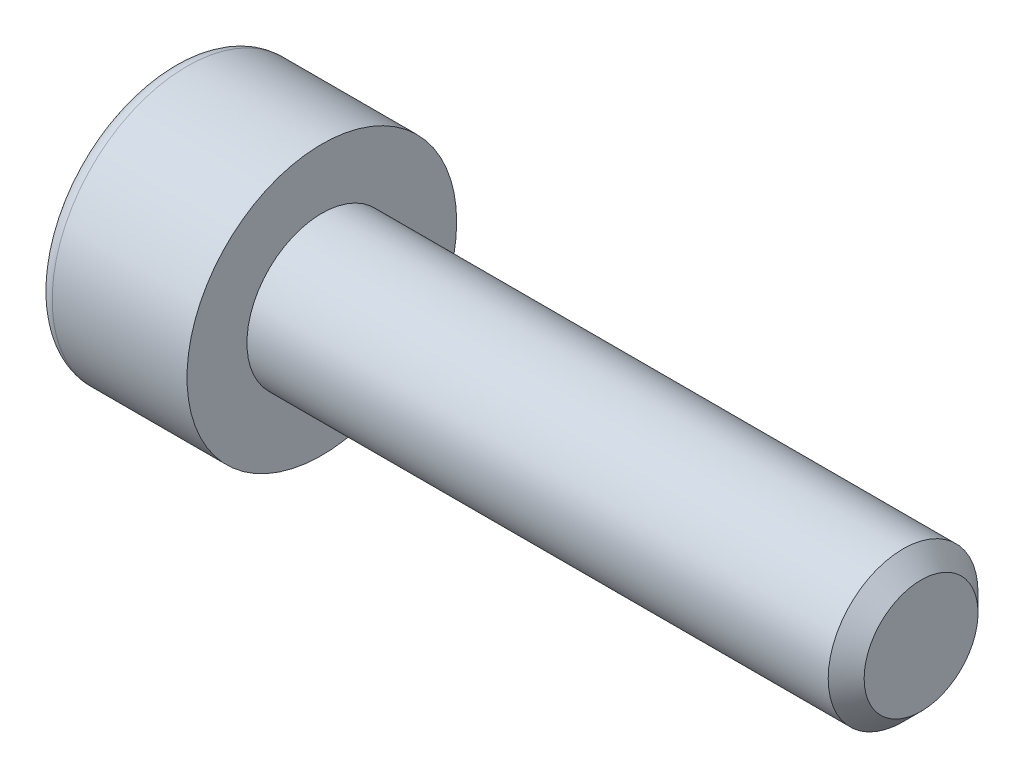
ISO-10303-21;
HEADER;
FILE_DESCRIPTION(('STEP AP214'),'2;1');
FILE_NAME('part.step','',(''),(''),'','','');
FILE_SCHEMA(('AUTOMOTIVE_DESIGN { 1 0 10303 214 1 1 1 1 }'));
ENDSEC;
DATA;
#1=APPLICATION_CONTEXT('core data for automotive mechanical design processes');
#2=APPLICATION_PROTOCOL_DEFINITION('international standard','automotive_design',2000,#1);
#3=PRODUCT_CONTEXT('',#1,'mechanical');
#4=PRODUCT('Part','Part','',(#3));
#5=PRODUCT_RELATED_PRODUCT_CATEGORY('part','',(#4));
#6=PRODUCT_DEFINITION_FORMATION('','',#4);
#7=PRODUCT_DEFINITION_CONTEXT('part definition',#1,'design');
#8=PRODUCT_DEFINITION('design','',#6,#7);
#9=PRODUCT_DEFINITION_SHAPE('','',#8);
#10=(LENGTH_UNIT() NAMED_UNIT(*) SI_UNIT(.MILLI.,.METRE.));
#11=(NAMED_UNIT(*) PLANE_ANGLE_UNIT() SI_UNIT($,.RADIAN.));
#12=(NAMED_UNIT(*) SI_UNIT($,.STERADIAN.) SOLID_ANGLE_UNIT());
#13=UNCERTAINTY_MEASURE_WITH_UNIT(LENGTH_MEASURE(1.E-05),#10,'distance_accuracy_value','');
#14=(GEOMETRIC_REPRESENTATION_CONTEXT(3) GLOBAL_UNCERTAINTY_ASSIGNED_CONTEXT((#13)) GLOBAL_UNIT_ASSIGNED_CONTEXT((#10,
#11,#12)) REPRESENTATION_CONTEXT('',''));
#15=CARTESIAN_POINT('',(0.,0.,0.));
#16=DIRECTION('',(0.,0.,1.));
#17=DIRECTION('',(1.,0.,0.));
#18=AXIS2_PLACEMENT_3D('',#15,#16,#17);
#19=CARTESIAN_POINT('',(-0.850000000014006,0.,0.));
#20=DIRECTION('',(-1.,0.,0.));
#21=DIRECTION('',(0.,0.,1.));
#22=AXIS2_PLACEMENT_3D('',#19,#20,#21);
#23=CONICAL_SURFACE('',#22,0.952380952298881,1.04719755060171);
#24=CARTESIAN_POINT('',(-0.300142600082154,-5.6843418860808E-11,0.));
#25=VERTEX_POINT('',#24);
#26=VERTEX_LOOP('',#25);
#27=FACE_BOUND('',#26,.T.);
#28=CARTESIAN_POINT('',(-0.850000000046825,0.,0.));
#29=DIRECTION('',(-1.,0.,0.));
#30=DIRECTION('',(0.,0.,1.));
#31=AXIS2_PLACEMENT_3D('',#28,#29,#30);
#32=CIRCLE('',#31,0.952380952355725);
#33=CARTESIAN_POINT('',(-0.850000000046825,0.,0.952380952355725));
#34=VERTEX_POINT('',#33);
#35=EDGE_CURVE('E22',#34,#34,#32,.T.);
#36=ORIENTED_EDGE('',*,*,#35,.T.);
#37=EDGE_LOOP('',(#36));
#38=FACE_BOUND('',#37,.T.);
#39=ADVANCED_FACE('F17',(#27,#38),#23,.F.);
#40=CARTESIAN_POINT('',(-0.85,0.,0.));
#41=DIRECTION('',(1.,0.,0.));
#42=DIRECTION('',(0.,0.,-1.));
#43=AXIS2_PLACEMENT_3D('',#40,#41,#42);
#44=PLANE('',#43);
#45=ORIENTED_EDGE('',*,*,#35,.F.);
#46=EDGE_LOOP('',(#45));
#47=FACE_BOUND('',#46,.T.);
#48=DIRECTION('',(0.,0.5,-0.866025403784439));
#49=VECTOR('',#48,1.);
#50=CARTESIAN_POINT('',(-0.85,-1.14892703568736,0.));
#51=LINE('',#50,#49);
#52=CARTESIAN_POINT('',(-0.85,-0.57446350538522,-0.995000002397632));
#53=VERTEX_POINT('',#52);
#54=CARTESIAN_POINT('',(-0.85,-1.14892703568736,0.));
#55=VERTEX_POINT('',#54);
#56=EDGE_CURVE('E282',#53,#55,#51,.F.);
#57=ORIENTED_EDGE('',*,*,#56,.T.);
#58=DIRECTION('',(0.,-0.5,-0.866025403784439));
#59=VECTOR('',#58,1.);
#60=CARTESIAN_POINT('',(-0.85,-0.574463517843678,0.995));
#61=LINE('',#60,#59);
#62=CARTESIAN_POINT('',(-0.85,-0.574463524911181,0.994999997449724));
#63=VERTEX_POINT('',#62);
#64=EDGE_CURVE('E287',#55,#63,#61,.F.);
#65=ORIENTED_EDGE('',*,*,#64,.T.);
#66=DIRECTION('',(0.,1.,0.));
#67=VECTOR('',#66,1.);
#68=CARTESIAN_POINT('',(-0.85,0.574463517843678,0.995));
#69=LINE('',#68,#67);
#70=CARTESIAN_POINT('',(-0.85,0.574463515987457,0.995000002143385));
#71=VERTEX_POINT('',#70);
#72=EDGE_CURVE('E84',#63,#71,#69,.T.);
#73=ORIENTED_EDGE('',*,*,#72,.T.);
#74=DIRECTION('',(0.,-0.5,0.866025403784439));
#75=VECTOR('',#74,1.);
#76=CARTESIAN_POINT('',(-0.85,1.14892703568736,0.));
#77=LINE('',#76,#75);
#78=CARTESIAN_POINT('',(-0.85,1.14892703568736,0.));
#79=VERTEX_POINT('',#78);
#80=EDGE_CURVE('E91',#71,#79,#77,.F.);
#81=ORIENTED_EDGE('',*,*,#80,.T.);
#82=DIRECTION('',(0.,0.5,0.866025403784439));
#83=VECTOR('',#82,1.);
#84=CARTESIAN_POINT('',(-0.85,0.574463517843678,-0.995));
#85=LINE('',#84,#83);
#86=CARTESIAN_POINT('',(-0.85,0.574463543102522,-0.994999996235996));
#87=VERTEX_POINT('',#86);
#88=EDGE_CURVE('E272',#79,#87,#85,.F.);
#89=ORIENTED_EDGE('',*,*,#88,.T.);
#90=DIRECTION('',(0.,1.,0.));
#91=VECTOR('',#90,1.);
#92=CARTESIAN_POINT('',(-0.85,-0.574463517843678,-0.995));
#93=LINE('',#92,#91);
#94=EDGE_CURVE('E275',#87,#53,#93,.F.);
#95=ORIENTED_EDGE('',*,*,#94,.T.);
#96=EDGE_LOOP('',(#57,#65,#73,#81,#89,#95));
#97=FACE_BOUND('',#96,.T.);
#98=ADVANCED_FACE('F148',(#47,#97),#44,.F.);
#99=CARTESIAN_POINT('',(-0.85,0.574463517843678,0.995));
#100=DIRECTION('',(0.,0.,1.));
#101=DIRECTION('',(1.,0.,0.));
#102=AXIS2_PLACEMENT_3D('',#99,#100,#101);
#103=PLANE('',#102);
#104=CARTESIAN_POINT('',(-2.34499999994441,0.,0.995));
#105=CARTESIAN_POINT('',(-2.3449743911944,-0.0305677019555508,0.995));
#106=CARTESIAN_POINT('',(-2.34640800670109,-0.0611198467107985,0.995));
#107=CARTESIAN_POINT('',(-2.35199243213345,-0.121922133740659,0.995));
#108=CARTESIAN_POINT('',(-2.3561383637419,-0.152172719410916,0.995));
#109=CARTESIAN_POINT('',(-2.3668659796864,-0.211759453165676,0.995));
#110=CARTESIAN_POINT('',(-2.37340998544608,-0.241102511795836,0.995));
#111=CARTESIAN_POINT('',(-2.38864217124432,-0.299229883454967,0.995));
#112=CARTESIAN_POINT('',(-2.39733102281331,-0.328014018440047,0.995));
#113=CARTESIAN_POINT('',(-2.41947932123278,-0.393688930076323,0.995));
#114=CARTESIAN_POINT('',(-2.43358464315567,-0.430359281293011,0.995));
#115=CARTESIAN_POINT('',(-2.46443795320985,-0.50302343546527,0.995));
#116=CARTESIAN_POINT('',(-2.48121157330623,-0.53900643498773,0.995));
#117=CARTESIAN_POINT('',(-2.49892704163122,-0.574463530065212,0.995));
#118=B_SPLINE_CURVE_WITH_KNOTS('',3,(#104,#105,#106,#107,#108,#109,#110,#111,#112,#113,#114,
#115,#116,#117),.UNSPECIFIED.,.F.,.F.,(4,2,2,2,2,2,4),(0.,0.0916446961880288,0.183125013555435,
0.273225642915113,0.36335451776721,0.481117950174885,0.600089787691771),.UNSPECIFIED.);
#119=CARTESIAN_POINT('',(-2.34499999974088,0.,0.994999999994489));
#120=VERTEX_POINT('',#119);
#121=CARTESIAN_POINT('',(-2.49892703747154,-0.574463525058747,0.994999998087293));
#122=VERTEX_POINT('',#121);
#123=EDGE_CURVE('E79',#120,#122,#118,.T.);
#124=ORIENTED_EDGE('',*,*,#123,.F.);
#125=CARTESIAN_POINT('',(-2.49892703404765,0.574463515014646,0.995));
#126=CARTESIAN_POINT('',(-2.47907510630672,0.534722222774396,0.995));
#127=CARTESIAN_POINT('',(-2.46039599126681,0.49430925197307,0.995));
#128=CARTESIAN_POINT('',(-2.42621425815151,0.411872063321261,0.995));
#129=CARTESIAN_POINT('',(-2.41073261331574,0.36983922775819,0.995));
#130=CARTESIAN_POINT('',(-2.38444123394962,0.285641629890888,0.995));
#131=CARTESIAN_POINT('',(-2.37350879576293,0.243516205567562,0.995));
#132=CARTESIAN_POINT('',(-2.35666503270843,0.15836168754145,0.995));
#133=CARTESIAN_POINT('',(-2.35073836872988,0.115335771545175,0.995));
#134=CARTESIAN_POINT('',(-2.34674431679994,0.0601561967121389,0.995));
#135=CARTESIAN_POINT('',(-2.34609249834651,0.048163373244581,0.995));
#136=CARTESIAN_POINT('',(-2.34521965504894,0.0241145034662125,0.995));
#137=CARTESIAN_POINT('',(-2.34500034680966,0.0120583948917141,0.995));
#138=CARTESIAN_POINT('',(-2.34499999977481,6.10102043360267E-13,0.995));
#139=B_SPLINE_CURVE_WITH_KNOTS('',3,(#125,#126,#127,#128,#129,#130,#131,#132,#133,#134,#135,
#136,#137,#138),.UNSPECIFIED.,.F.,.F.,(4,2,2,2,2,2,4),(0.,0.133369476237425,0.267587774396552,
0.397905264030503,0.527821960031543,0.563847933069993,0.600016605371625),.UNSPECIFIED.);
#140=CARTESIAN_POINT('',(-2.49892703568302,0.574463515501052,0.995000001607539));
#141=VERTEX_POINT('',#140);
#142=EDGE_CURVE('E72',#141,#120,#139,.T.);
#143=ORIENTED_EDGE('',*,*,#142,.F.);
#144=DIRECTION('',(1.,0.,0.));
#145=VECTOR('',#144,1.);
#146=CARTESIAN_POINT('',(-0.85,0.574463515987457,0.995000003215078));
#147=LINE('',#146,#145);
#148=EDGE_CURVE('E76',#141,#71,#147,.T.);
#149=ORIENTED_EDGE('',*,*,#148,.T.);
#150=ORIENTED_EDGE('',*,*,#72,.F.);
#151=DIRECTION('',(1.,0.,0.));
#152=VECTOR('',#151,1.);
#153=CARTESIAN_POINT('',(-0.85,-0.574463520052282,0.994999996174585));
#154=LINE('',#153,#152);
#155=EDGE_CURVE('E284',#63,#122,#154,.F.);
#156=ORIENTED_EDGE('',*,*,#155,.T.);
#157=EDGE_LOOP('',(#124,#143,#149,#150,#156));
#158=FACE_BOUND('',#157,.T.);
#159=ADVANCED_FACE('F74',(#158),#103,.F.);
#160=CARTESIAN_POINT('',(-0.85,-0.574463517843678,0.995));
#161=DIRECTION('',(0.,-0.866025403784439,0.5));
#162=DIRECTION('',(0.,-0.5,-0.866025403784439));
#163=AXIS2_PLACEMENT_3D('',#160,#161,#162);
#164=PLANE('',#163);
#165=CARTESIAN_POINT('',(-2.49913739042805,-1.14913733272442,-0.00036424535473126));
#166=CARTESIAN_POINT('',(-2.47938857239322,-1.12938020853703,0.0338560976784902));
#167=CARTESIAN_POINT('',(-2.46079873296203,-1.10929266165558,0.0686487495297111));
#168=CARTESIAN_POINT('',(-2.42675971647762,-1.0683313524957,0.13959581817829));
#169=CARTESIAN_POINT('',(-2.4113295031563,-1.04745368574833,0.175756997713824));
#170=CARTESIAN_POINT('',(-2.38489633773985,-1.00535430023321,0.248675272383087));
#171=CARTESIAN_POINT('',(-2.37382694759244,-0.98414331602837,0.285413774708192));
#172=CARTESIAN_POINT('',(-2.35677080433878,-0.94125421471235,0.35969987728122));
#173=CARTESIAN_POINT('',(-2.35077130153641,-0.91957741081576,0.397245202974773));
#174=CARTESIAN_POINT('',(-2.34536065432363,-0.8822249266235,0.461941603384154));
#175=CARTESIAN_POINT('',(-2.34455998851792,-0.866597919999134,0.489008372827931));
#176=CARTESIAN_POINT('',(-2.34590101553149,-0.835374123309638,0.543089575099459));
#177=CARTESIAN_POINT('',(-2.34804335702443,-0.819777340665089,0.570103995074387));
#178=CARTESIAN_POINT('',(-2.35874331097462,-0.773209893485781,0.650761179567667));
#179=CARTESIAN_POINT('',(-2.37157503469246,-0.742470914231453,0.704002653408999));
#180=CARTESIAN_POINT('',(-2.40253293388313,-0.688539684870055,0.797414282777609));
#181=CARTESIAN_POINT('',(-2.41903118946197,-0.66509374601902,0.838023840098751));
#182=CARTESIAN_POINT('',(-2.45619453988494,-0.619119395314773,0.91765375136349));
#183=CARTESIAN_POINT('',(-2.47684610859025,-0.596588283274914,0.956678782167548));
#184=CARTESIAN_POINT('',(-2.49892703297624,-0.574463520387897,0.994999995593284));
#185=B_SPLINE_CURVE_WITH_KNOTS('',3,(#165,#166,#167,#168,#169,#170,#171,#172,#173,#174,#175,
#176,#177,#178,#179,#180,#181,#182,#183,#184),.UNSPECIFIED.,.F.,.F.,(4,2,2,2,2,2,2,2,2,4),(0.,
0.132615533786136,0.266005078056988,0.397275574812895,0.528214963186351,0.621871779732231,
0.715549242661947,0.902956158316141,1.0518860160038,1.20033848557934),.UNSPECIFIED.);
#186=CARTESIAN_POINT('',(-2.49967441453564,-1.14925495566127,1.37088865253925E-05));
#187=VERTEX_POINT('',#186);
#188=EDGE_CURVE('E92',#187,#122,#185,.T.);
#189=ORIENTED_EDGE('',*,*,#188,.T.);
#190=ORIENTED_EDGE('',*,*,#155,.F.);
#191=ORIENTED_EDGE('',*,*,#64,.F.);
#192=DIRECTION('',(-1.,0.,0.));
#193=VECTOR('',#192,1.);
#194=CARTESIAN_POINT('',(-0.85,-1.14892703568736,0.));
#195=LINE('',#194,#193);
#196=EDGE_CURVE('E245',#55,#187,#195,.T.);
#197=ORIENTED_EDGE('',*,*,#196,.T.);
#198=EDGE_LOOP('',(#189,#190,#191,#197));
#199=FACE_BOUND('',#198,.T.);
#200=ADVANCED_FACE('F147',(#199),#164,.F.);
#201=CARTESIAN_POINT('',(-0.85,-1.14892703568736,0.));
#202=DIRECTION('',(0.,-0.866025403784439,-0.5));
#203=DIRECTION('',(0.,0.5,-0.866025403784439));
#204=AXIS2_PLACEMENT_3D('',#201,#202,#203);
#205=PLANE('',#204);
#206=CARTESIAN_POINT('',(-2.49892702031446,-0.574463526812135,-0.994999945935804));
#207=CARTESIAN_POINT('',(-2.47920125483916,-0.594208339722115,-0.960800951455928));
#208=CARTESIAN_POINT('',(-2.46063412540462,-0.614283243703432,-0.926030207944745));
#209=CARTESIAN_POINT('',(-2.42663854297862,-0.655218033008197,-0.855129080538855));
#210=CARTESIAN_POINT('',(-2.41122899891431,-0.676081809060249,-0.818991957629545));
#211=CARTESIAN_POINT('',(-2.38483285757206,-0.718152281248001,-0.746123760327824));
#212=CARTESIAN_POINT('',(-2.37377984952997,-0.739348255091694,-0.709411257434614));
#213=CARTESIAN_POINT('',(-2.35674986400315,-0.782206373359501,-0.635178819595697));
#214=CARTESIAN_POINT('',(-2.35076018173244,-0.803867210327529,-0.597661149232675));
#215=CARTESIAN_POINT('',(-2.34535763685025,-0.841202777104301,-0.532994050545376));
#216=CARTESIAN_POINT('',(-2.34455932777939,-0.856829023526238,-0.505928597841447));
#217=CARTESIAN_POINT('',(-2.34590474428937,-0.888051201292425,-0.451850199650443));
#218=CARTESIAN_POINT('',(-2.34804911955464,-0.903647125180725,-0.424837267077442));
#219=CARTESIAN_POINT('',(-2.35875462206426,-0.950212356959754,-0.344183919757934));
#220=CARTESIAN_POINT('',(-2.37158937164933,-0.980949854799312,-0.290945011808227));
#221=CARTESIAN_POINT('',(-2.40257169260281,-1.03491414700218,-0.197476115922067));
#222=CARTESIAN_POINT('',(-2.41909998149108,-1.0583933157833,-0.156809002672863));
#223=CARTESIAN_POINT('',(-2.45633304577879,-1.10443127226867,-0.0770689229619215));
#224=CARTESIAN_POINT('',(-2.47702419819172,-1.12699278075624,-0.0379912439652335));
#225=CARTESIAN_POINT('',(-2.49914689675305,-1.14914683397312,0.000380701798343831));
#226=B_SPLINE_CURVE_WITH_KNOTS('',3,(#206,#207,#208,#209,#210,#211,#212,#213,#214,#215,#216,
#217,#218,#219,#220,#221,#222,#223,#224,#225),.UNSPECIFIED.,.F.,.F.,(4,2,2,2,2,2,2,2,2,4),(0.,
0.132518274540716,0.265808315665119,0.396979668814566,0.527820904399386,0.621472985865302,
0.715145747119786,0.902546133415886,1.05169311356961,1.20035972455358),.UNSPECIFIED.);
#227=CARTESIAN_POINT('',(-2.49892702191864,-0.57446349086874,-0.995));
#228=VERTEX_POINT('',#227);
#229=EDGE_CURVE('E238',#228,#187,#226,.T.);
#230=ORIENTED_EDGE('',*,*,#229,.T.);
#231=ORIENTED_EDGE('',*,*,#196,.F.);
#232=ORIENTED_EDGE('',*,*,#56,.F.);
#233=DIRECTION('',(-1.,0.,0.));
#234=VECTOR('',#233,1.);
#235=CARTESIAN_POINT('',(-0.85,-0.5744635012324,-0.995));
#236=LINE('',#235,#234);
#237=EDGE_CURVE('E279',#53,#228,#236,.T.);
#238=ORIENTED_EDGE('',*,*,#237,.T.);
#239=EDGE_LOOP('',(#230,#231,#232,#238));
#240=FACE_BOUND('',#239,.T.);
#241=ADVANCED_FACE('F154',(#240),#205,.F.);
#242=CARTESIAN_POINT('',(-0.85,0.574463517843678,-0.995));
#243=DIRECTION('',(0.,0.866025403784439,-0.5));
#244=DIRECTION('',(0.,0.5,0.866025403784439));
#245=AXIS2_PLACEMENT_3D('',#242,#243,#244);
#246=PLANE('',#245);
#247=CARTESIAN_POINT('',(-2.49913349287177,1.14913343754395,0.000357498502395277));
#248=CARTESIAN_POINT('',(-2.47938510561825,1.12937654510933,-0.0338624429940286));
#249=CARTESIAN_POINT('',(-2.46079569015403,1.10928923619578,-0.0686546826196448));
#250=CARTESIAN_POINT('',(-2.42675748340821,1.06832842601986,-0.139600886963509));
#251=CARTESIAN_POINT('',(-2.41132765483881,1.04745102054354,-0.17576161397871));
#252=CARTESIAN_POINT('',(-2.38489517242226,1.00535217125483,-0.24867895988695));
#253=CARTESIAN_POINT('',(-2.37382608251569,0.984141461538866,-0.285416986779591));
#254=CARTESIAN_POINT('',(-2.35677041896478,0.941252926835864,-0.359702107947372));
#255=CARTESIAN_POINT('',(-2.35077109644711,0.919576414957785,-0.397246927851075));
#256=CARTESIAN_POINT('',(-2.34536059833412,0.882224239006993,-0.461942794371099));
#257=CARTESIAN_POINT('',(-2.34455997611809,0.866597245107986,-0.489009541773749));
#258=CARTESIAN_POINT('',(-2.34590108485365,0.835373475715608,-0.543090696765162));
#259=CARTESIAN_POINT('',(-2.34804346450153,0.819776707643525,-0.570105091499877));
#260=CARTESIAN_POINT('',(-2.35874352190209,0.7732093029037,-0.650762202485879));
#261=CARTESIAN_POINT('',(-2.37157530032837,0.742470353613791,-0.704003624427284));
#262=CARTESIAN_POINT('',(-2.40253322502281,0.688539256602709,-0.797415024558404));
#263=CARTESIAN_POINT('',(-2.41903143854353,0.665093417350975,-0.8380244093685));
#264=CARTESIAN_POINT('',(-2.45619466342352,0.619119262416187,-0.917653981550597));
#265=CARTESIAN_POINT('',(-2.47684614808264,0.596588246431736,-0.956678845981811));
#266=CARTESIAN_POINT('',(-2.49892697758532,0.574463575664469,-0.994999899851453));
#267=B_SPLINE_CURVE_WITH_KNOTS('',3,(#247,#248,#249,#250,#251,#252,#253,#254,#255,#256,#257,
#258,#259,#260,#261,#262,#263,#264,#265,#266),.UNSPECIFIED.,.F.,.F.,(4,2,2,2,2,2,2,2,2,4),(0.,
0.132613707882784,0.26600138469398,0.397270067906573,0.528207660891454,0.621864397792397,
0.715541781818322,0.902948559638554,1.05187781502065,1.20032966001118),.UNSPECIFIED.);
#268=CARTESIAN_POINT('',(-2.49967445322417,1.14925510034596,-2.50553599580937E-05));
#269=VERTEX_POINT('',#268);
#270=CARTESIAN_POINT('',(-2.49892701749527,0.574463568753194,-0.994999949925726));
#271=VERTEX_POINT('',#270);
#272=EDGE_CURVE('E239',#269,#271,#267,.T.);
#273=ORIENTED_EDGE('',*,*,#272,.T.);
#274=DIRECTION('',(-1.,0.,0.));
#275=VECTOR('',#274,1.);
#276=CARTESIAN_POINT('',(-0.85,0.574463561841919,-0.995));
#277=LINE('',#276,#275);
#278=EDGE_CURVE('E269',#271,#87,#277,.F.);
#279=ORIENTED_EDGE('',*,*,#278,.T.);
#280=ORIENTED_EDGE('',*,*,#88,.F.);
#281=DIRECTION('',(-1.,0.,0.));
#282=VECTOR('',#281,1.);
#283=CARTESIAN_POINT('',(-0.85,1.14892703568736,0.));
#284=LINE('',#283,#282);
#285=EDGE_CURVE('E93',#79,#269,#284,.T.);
#286=ORIENTED_EDGE('',*,*,#285,.T.);
#287=EDGE_LOOP('',(#273,#279,#280,#286));
#288=FACE_BOUND('',#287,.T.);
#289=ADVANCED_FACE('F303',(#288),#246,.F.);
#290=CARTESIAN_POINT('',(-0.85,-0.574463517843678,-0.995));
#291=DIRECTION('',(0.,0.,-1.));
#292=DIRECTION('',(-1.,0.,0.));
#293=AXIS2_PLACEMENT_3D('',#290,#291,#292);
#294=PLANE('',#293);
#295=CARTESIAN_POINT('',(-2.49892707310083,0.57446354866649,-0.994999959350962));
#296=CARTESIAN_POINT('',(-2.47920148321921,0.534974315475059,-0.994999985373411));
#297=CARTESIAN_POINT('',(-2.4606345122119,0.494824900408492,-0.994999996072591));
#298=CARTESIAN_POINT('',(-2.42663917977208,0.412956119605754,-0.995000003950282));
#299=CARTESIAN_POINT('',(-2.41122972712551,0.371228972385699,-0.995000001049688));
#300=CARTESIAN_POINT('',(-2.38483342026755,0.287088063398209,-0.994999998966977));
#301=CARTESIAN_POINT('',(-2.37378023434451,0.244695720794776,-0.994999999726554));
#302=CARTESIAN_POINT('',(-2.35674998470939,0.158978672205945,-0.995000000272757));
#303=CARTESIAN_POINT('',(-2.35076021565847,0.11565658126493,-0.995000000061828));
#304=CARTESIAN_POINT('',(-2.34535762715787,0.0409848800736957,-0.994999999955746));
#305=CARTESIAN_POINT('',(-2.34455932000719,0.00973223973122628,-0.99499999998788));
#306=CARTESIAN_POINT('',(-2.34590476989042,-0.0527124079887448,-0.995000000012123));
#307=CARTESIAN_POINT('',(-2.34804917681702,-0.0839044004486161,-0.995000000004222));
#308=CARTESIAN_POINT('',(-2.35875473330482,-0.17703472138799,-0.994999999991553));
#309=CARTESIAN_POINT('',(-2.37158942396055,-0.238509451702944,-0.994999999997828));
#310=CARTESIAN_POINT('',(-2.40254901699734,-0.346358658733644,-0.995000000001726));
#311=CARTESIAN_POINT('',(-2.41904542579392,-0.393240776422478,-0.995000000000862));
#312=CARTESIAN_POINT('',(-2.45620299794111,-0.48517024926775,-0.994999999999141));
#313=CARTESIAN_POINT('',(-2.47685060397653,-0.530223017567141,-0.994999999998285));
#314=CARTESIAN_POINT('',(-2.49892701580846,-0.574463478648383,-0.995));
#315=B_SPLINE_CURVE_WITH_KNOTS('',3,(#295,#296,#297,#298,#299,#300,#301,#302,#303,#304,#305,
#306,#307,#308,#309,#310,#311,#312,#313,#314),.UNSPECIFIED.,.F.,.F.,(4,2,2,2,2,2,2,2,2,4),(0.,
0.13251703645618,0.26580584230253,0.396978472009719,0.527820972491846,0.621473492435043,
0.71514669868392,0.902546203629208,1.05144676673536,1.19986871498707),.UNSPECIFIED.);
#316=EDGE_CURVE('E106',#271,#228,#315,.T.);
#317=ORIENTED_EDGE('',*,*,#316,.T.);
#318=ORIENTED_EDGE('',*,*,#237,.F.);
#319=ORIENTED_EDGE('',*,*,#94,.F.);
#320=ORIENTED_EDGE('',*,*,#278,.F.);
#321=EDGE_LOOP('',(#317,#318,#319,#320));
#322=FACE_BOUND('',#321,.T.);
#323=ADVANCED_FACE('F179',(#322),#294,.F.);
#324=CARTESIAN_POINT('',(-0.85,1.14892703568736,0.));
#325=DIRECTION('',(0.,0.866025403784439,0.5));
#326=DIRECTION('',(0.,-0.5,0.866025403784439));
#327=AXIS2_PLACEMENT_3D('',#324,#325,#326);
#328=PLANE('',#327);
#329=CARTESIAN_POINT('',(-2.49892703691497,0.574463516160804,0.995000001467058));
#330=CARTESIAN_POINT('',(-2.47920127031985,0.594208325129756,0.960800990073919));
#331=CARTESIAN_POINT('',(-2.46063413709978,0.61428323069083,0.926030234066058));
#332=CARTESIAN_POINT('',(-2.42663854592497,0.655218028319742,0.855129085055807));
#333=CARTESIAN_POINT('',(-2.41122899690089,0.676081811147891,0.818991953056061));
#334=CARTESIAN_POINT('',(-2.38483285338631,0.71815228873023,0.746123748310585));
#335=CARTESIAN_POINT('',(-2.37377984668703,0.739348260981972,0.709411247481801));
#336=CARTESIAN_POINT('',(-2.35674986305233,0.782206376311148,0.635178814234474));
#337=CARTESIAN_POINT('',(-2.35076018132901,0.803867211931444,0.597661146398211));
#338=CARTESIAN_POINT('',(-2.34535763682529,0.841202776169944,0.5329940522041));
#339=CARTESIAN_POINT('',(-2.34455932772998,0.856829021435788,0.50592860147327));
#340=CARTESIAN_POINT('',(-2.34590474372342,0.888051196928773,0.451850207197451));
#341=CARTESIAN_POINT('',(-2.3480491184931,0.903647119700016,0.424837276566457));
#342=CARTESIAN_POINT('',(-2.35875462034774,0.950212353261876,0.344183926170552));
#343=CARTESIAN_POINT('',(-2.37158937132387,0.98094985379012,0.290945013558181));
#344=CARTESIAN_POINT('',(-2.40257210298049,1.03491486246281,0.197474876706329));
#345=CARTESIAN_POINT('',(-2.41910096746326,1.05839471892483,0.156806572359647));
#346=CARTESIAN_POINT('',(-2.45633539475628,1.10443399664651,0.0770642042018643));
#347=CARTESIAN_POINT('',(-2.47702733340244,1.12699613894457,0.0379854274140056));
#348=CARTESIAN_POINT('',(-2.49915086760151,1.14915080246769,-0.000387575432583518));
#349=B_SPLINE_CURVE_WITH_KNOTS('',3,(#329,#330,#331,#332,#333,#334,#335,#336,#337,#338,#339,
#340,#341,#342,#343,#344,#345,#346,#347,#348),.UNSPECIFIED.,.F.,.F.,(4,2,2,2,2,2,2,2,2,4),(0.,
0.132518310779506,0.26580838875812,0.396979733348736,0.52782096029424,0.621473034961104,
0.715145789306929,0.90254619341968,1.05169762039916,1.20036864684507),.UNSPECIFIED.);
#350=EDGE_CURVE('E89',#141,#269,#349,.T.);
#351=ORIENTED_EDGE('',*,*,#350,.T.);
#352=ORIENTED_EDGE('',*,*,#285,.F.);
#353=ORIENTED_EDGE('',*,*,#80,.F.);
#354=ORIENTED_EDGE('',*,*,#148,.F.);
#355=EDGE_LOOP('',(#351,#352,#353,#354));
#356=FACE_BOUND('',#355,.T.);
#357=ADVANCED_FACE('F87',(#356),#328,.F.);
#358=CARTESIAN_POINT('',(-2.50093213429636,0.,0.));
#359=DIRECTION('',(-1.,0.,0.));
#360=DIRECTION('',(0.,0.,1.));
#361=AXIS2_PLACEMENT_3D('',#358,#359,#360);
#362=CONICAL_SURFACE('',#361,1.15093213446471,0.785398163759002);
#363=CARTESIAN_POINT('',(-2.5,0.,0.));
#364=DIRECTION('',(-1.,0.,0.));
#365=DIRECTION('',(0.,0.,1.));
#366=AXIS2_PLACEMENT_3D('',#363,#364,#365);
#367=CIRCLE('',#366,1.15000000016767);
#368=CARTESIAN_POINT('',(-2.49999999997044,0.,1.15000000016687));
#369=VERTEX_POINT('',#368);
#370=EDGE_CURVE('E100',#369,#187,#367,.F.);
#371=ORIENTED_EDGE('',*,*,#370,.F.);
#372=DIRECTION('',(0.707106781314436,0.,-0.707106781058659));
#373=VECTOR('',#372,1.);
#374=CARTESIAN_POINT('',(-499000.,0.,498998.649819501));
#375=LINE('',#374,#373);
#376=EDGE_CURVE('E101',#369,#120,#375,.T.);
#377=ORIENTED_EDGE('',*,*,#376,.T.);
#378=ORIENTED_EDGE('',*,*,#123,.T.);
#379=ORIENTED_EDGE('',*,*,#188,.F.);
#380=EDGE_LOOP('',(#371,#377,#378,#379));
#381=FACE_BOUND('',#380,.T.);
#382=ADVANCED_FACE('F167',(#381),#362,.F.);
#383=CARTESIAN_POINT('',(-2.49946299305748,0.,0.));
#384=DIRECTION('',(-1.,0.,0.));
#385=DIRECTION('',(0.,0.,1.));
#386=AXIS2_PLACEMENT_3D('',#383,#384,#385);
#387=CONICAL_SURFACE('',#386,1.14946299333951,0.785398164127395);
#388=ORIENTED_EDGE('',*,*,#272,.F.);
#389=CARTESIAN_POINT('',(-2.5,0.,0.));
#390=DIRECTION('',(-1.,0.,0.));
#391=DIRECTION('',(0.,0.,1.));
#392=AXIS2_PLACEMENT_3D('',#389,#390,#391);
#393=CIRCLE('',#392,1.15000000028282);
#394=EDGE_CURVE('E104',#187,#269,#393,.F.);
#395=ORIENTED_EDGE('',*,*,#394,.F.);
#396=ORIENTED_EDGE('',*,*,#229,.F.);
#397=ORIENTED_EDGE('',*,*,#316,.F.);
#398=EDGE_LOOP('',(#388,#395,#396,#397));
#399=FACE_BOUND('',#398,.T.);
#400=ADVANCED_FACE('F130',(#399),#387,.F.);
#401=CARTESIAN_POINT('',(-2.5009317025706,0.,0.));
#402=DIRECTION('',(-1.,0.,0.));
#403=DIRECTION('',(0.,0.,1.));
#404=AXIS2_PLACEMENT_3D('',#401,#402,#403);
#405=CONICAL_SURFACE('',#404,1.15093170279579,0.785398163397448);
#406=ORIENTED_EDGE('',*,*,#350,.F.);
#407=ORIENTED_EDGE('',*,*,#142,.T.);
#408=ORIENTED_EDGE('',*,*,#376,.F.);
#409=CARTESIAN_POINT('',(-2.5,0.,0.));
#410=DIRECTION('',(-1.,0.,0.));
#411=DIRECTION('',(0.,0.,1.));
#412=AXIS2_PLACEMENT_3D('',#409,#410,#411);
#413=CIRCLE('',#412,1.15000000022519);
#414=EDGE_CURVE('E98',#269,#369,#413,.F.);
#415=ORIENTED_EDGE('',*,*,#414,.F.);
#416=EDGE_LOOP('',(#406,#407,#408,#415));
#417=FACE_BOUND('',#416,.T.);
#418=ADVANCED_FACE('F96',(#417),#405,.F.);
#419=CARTESIAN_POINT('',(-2.5,1.575,0.));
#420=DIRECTION('',(-1.,0.,0.));
#421=DIRECTION('',(0.,0.,1.));
#422=AXIS2_PLACEMENT_3D('',#419,#420,#421);
#423=PLANE('',#422);
#424=ORIENTED_EDGE('',*,*,#394,.T.);
#425=ORIENTED_EDGE('',*,*,#414,.T.);
#426=ORIENTED_EDGE('',*,*,#370,.T.);
#427=EDGE_LOOP('',(#424,#425,#426));
#428=FACE_BOUND('',#427,.T.);
#429=CARTESIAN_POINT('',(-2.5,0.,1.99999999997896));
#430=CARTESIAN_POINT('',(-2.50000000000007,-0.0213602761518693,1.99999441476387));
#431=CARTESIAN_POINT('',(-2.49999999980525,-0.0427203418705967,1.99964659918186));
#432=CARTESIAN_POINT('',(-2.49999999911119,-0.0850058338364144,1.99828072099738));
#433=CARTESIAN_POINT('',(-2.4999999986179,-0.105931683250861,1.99727573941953));
#434=CARTESIAN_POINT('',(-2.49999999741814,-0.14732977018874,1.99463547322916));
#435=CARTESIAN_POINT('',(-2.49999999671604,-0.16780282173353,1.99301299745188));
#436=CARTESIAN_POINT('',(-2.49999999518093,-0.208277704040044,1.98917779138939));
#437=CARTESIAN_POINT('',(-2.49999999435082,-0.228280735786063,1.98697757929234));
#438=CARTESIAN_POINT('',(-2.49999999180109,-0.2869478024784,1.97962724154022));
#439=CARTESIAN_POINT('',(-2.49999998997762,-0.325511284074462,1.97364625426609));
#440=CARTESIAN_POINT('',(-2.49999998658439,-0.400597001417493,1.95974219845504));
#441=CARTESIAN_POINT('',(-2.49999998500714,-0.437136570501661,1.95191200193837));
#442=CARTESIAN_POINT('',(-2.49999998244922,-0.508117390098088,1.93461016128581));
#443=CARTESIAN_POINT('',(-2.49999998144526,-0.542580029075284,1.92522630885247));
#444=CARTESIAN_POINT('',(-2.49999998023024,-0.609373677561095,1.90510517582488));
#445=CARTESIAN_POINT('',(-2.49999997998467,-0.641729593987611,1.89445048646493));
#446=CARTESIAN_POINT('',(-2.49999998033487,-0.70430210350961,1.87206087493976));
#447=CARTESIAN_POINT('',(-2.49999998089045,-0.734546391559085,1.86040330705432));
#448=CARTESIAN_POINT('',(-2.49999998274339,-0.792908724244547,1.83626519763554));
#449=CARTESIAN_POINT('',(-2.49999998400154,-0.821056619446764,1.82385678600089));
#450=CARTESIAN_POINT('',(-2.49999998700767,-0.875257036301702,1.79845747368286));
#451=CARTESIAN_POINT('',(-2.49999998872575,-0.901340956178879,1.78553353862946));
#452=CARTESIAN_POINT('',(-2.49999999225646,-0.951458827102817,1.75932646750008));
#453=CARTESIAN_POINT('',(-2.49999999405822,-0.97552516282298,1.74610523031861));
#454=CARTESIAN_POINT('',(-2.49999999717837,-1.02166493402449,1.71950950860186));
#455=CARTESIAN_POINT('',(-2.4999999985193,-1.04377121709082,1.70619198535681));
#456=CARTESIAN_POINT('',(-2.50000000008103,-1.08605666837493,1.67959251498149));
#457=CARTESIAN_POINT('',(-2.50000000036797,-1.10626867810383,1.66636274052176));
#458=CARTESIAN_POINT('',(-2.49999999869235,-1.14483826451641,1.64011061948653));
#459=CARTESIAN_POINT('',(-2.49999999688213,-1.16322820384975,1.62713583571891));
#460=CARTESIAN_POINT('',(-2.49999999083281,-1.19822860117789,1.60154977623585));
#461=CARTESIAN_POINT('',(-2.49999998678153,-1.2148706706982,1.58898159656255));
#462=CARTESIAN_POINT('',(-2.49999996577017,-1.26029768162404,1.55355457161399));
#463=CARTESIAN_POINT('',(-2.49999994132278,-1.28866620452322,1.53015601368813));
#464=CARTESIAN_POINT('',(-2.49999989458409,-1.32996111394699,1.49414084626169));
#465=CARTESIAN_POINT('',(-2.49999987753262,-1.34339577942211,1.48210030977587));
#466=CARTESIAN_POINT('',(-2.49999980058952,-1.36836778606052,1.45913822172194));
#467=CARTESIAN_POINT('',(-2.49999974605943,-1.37994004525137,1.44825484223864));
#468=CARTESIAN_POINT('',(-2.49999972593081,-1.3944580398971,1.43421990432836));
#469=CARTESIAN_POINT('',(-2.49999972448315,-1.39754467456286,1.43121361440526));
#470=CARTESIAN_POINT('',(-2.49999972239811,-1.40784842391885,1.42111055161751));
#471=CARTESIAN_POINT('',(-2.49999972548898,-1.41501988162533,1.41396715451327));
#472=CARTESIAN_POINT('',(-2.49999973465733,-1.43560517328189,1.39314830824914));
#473=CARTESIAN_POINT('',(-2.49999974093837,-1.44887796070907,1.37933302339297));
#474=CARTESIAN_POINT('',(-2.49999975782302,-1.4804187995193,1.34554263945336));
#475=CARTESIAN_POINT('',(-2.49999976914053,-1.49848605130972,1.32537992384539));
#476=CARTESIAN_POINT('',(-2.49999979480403,-1.53894678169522,1.2783380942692));
#477=CARTESIAN_POINT('',(-2.49999980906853,-1.5610615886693,1.25121811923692));
#478=CARTESIAN_POINT('',(-2.49999983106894,-1.594955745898,1.20735154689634));
#479=CARTESIAN_POINT('',(-2.49999983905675,-1.60721444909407,1.19097245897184));
#480=CARTESIAN_POINT('',(-2.49999985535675,-1.63238460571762,1.15624388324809));
#481=CARTESIAN_POINT('',(-2.49999986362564,-1.64524459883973,1.13785698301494));
#482=CARTESIAN_POINT('',(-2.49999987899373,-1.66942628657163,1.10201320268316));
#483=CARTESIAN_POINT('',(-2.49999988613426,-1.6807918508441,1.08458586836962));
#484=CARTESIAN_POINT('',(-2.49999990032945,-1.70374837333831,1.04815569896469));
#485=CARTESIAN_POINT('',(-2.4999999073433,-1.71529964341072,1.02912783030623));
#486=CARTESIAN_POINT('',(-2.49999992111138,-1.73849367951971,0.989442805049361));
#487=CARTESIAN_POINT('',(-2.4999999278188,-1.75009320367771,0.968760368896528));
#488=CARTESIAN_POINT('',(-2.49999994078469,-1.77323752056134,0.925716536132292));
#489=CARTESIAN_POINT('',(-2.49999994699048,-1.78473541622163,0.903329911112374));
#490=CARTESIAN_POINT('',(-2.49999995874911,-1.80751745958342,0.856834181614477));
#491=CARTESIAN_POINT('',(-2.49999996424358,-1.81875095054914,0.83270024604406));
#492=CARTESIAN_POINT('',(-2.49999997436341,-1.84083232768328,0.782674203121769));
#493=CARTESIAN_POINT('',(-2.49999997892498,-1.85162571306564,0.756758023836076));
#494=CARTESIAN_POINT('',(-2.49999998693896,-1.87264222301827,0.703142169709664));
#495=CARTESIAN_POINT('',(-2.49999999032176,-1.88280693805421,0.675419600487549));
#496=CARTESIAN_POINT('',(-2.49999999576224,-1.90236886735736,0.618176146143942));
#497=CARTESIAN_POINT('',(-2.49999999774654,-1.91170372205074,0.588633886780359));
#498=CARTESIAN_POINT('',(-2.49999999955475,-1.92586685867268,0.539902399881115));
#499=CARTESIAN_POINT('',(-2.49999999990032,-1.93110440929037,0.520830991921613));
#500=CARTESIAN_POINT('',(-2.50000000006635,-1.94114075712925,0.482046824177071));
#501=CARTESIAN_POINT('',(-2.49999999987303,-1.94592473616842,0.462330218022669));
#502=CARTESIAN_POINT('',(-2.49999999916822,-1.95500432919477,0.422262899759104));
#503=CARTESIAN_POINT('',(-2.49999999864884,-1.95928462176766,0.401908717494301));
#504=CARTESIAN_POINT('',(-2.49999999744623,-1.96730651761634,0.360575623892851));
#505=CARTESIAN_POINT('',(-2.49999999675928,-1.97103231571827,0.339593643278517));
#506=CARTESIAN_POINT('',(-2.49999999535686,-1.97789366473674,0.297017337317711));
#507=CARTESIAN_POINT('',(-2.49999999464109,-1.98101293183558,0.275420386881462));
#508=CARTESIAN_POINT('',(-2.49999999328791,-1.98660873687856,0.231629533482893));
#509=CARTESIAN_POINT('',(-2.49999999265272,-1.98906852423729,0.209433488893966));
#510=CARTESIAN_POINT('',(-2.49999999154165,-1.99329206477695,0.164463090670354));
#511=CARTESIAN_POINT('',(-2.49999999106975,-1.99503861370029,0.141687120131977));
#512=CARTESIAN_POINT('',(-2.49999999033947,-1.99778173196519,0.0955789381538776));
#513=CARTESIAN_POINT('',(-2.49999999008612,-1.99876065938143,0.0722456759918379));
#514=CARTESIAN_POINT('',(-2.49999998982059,-1.99991413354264,0.0250485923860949));
#515=CARTESIAN_POINT('',(-2.49999998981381,-2.00007061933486,0.00118432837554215));
#516=CARTESIAN_POINT('',(-2.4999999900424,-1.99952456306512,-0.0470452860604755));
#517=CARTESIAN_POINT('',(-2.49999999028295,-1.99880356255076,-0.0714104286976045));
#518=CARTESIAN_POINT('',(-2.4999999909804,-1.99644786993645,-0.120608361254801));
#519=CARTESIAN_POINT('',(-2.49999999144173,-1.99479434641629,-0.145440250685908));
#520=CARTESIAN_POINT('',(-2.49999999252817,-1.9905191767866,-0.195534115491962));
#521=CARTESIAN_POINT('',(-2.49999999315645,-1.98787835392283,-0.220794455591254));
#522=CARTESIAN_POINT('',(-2.49999999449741,-1.98157466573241,-0.271703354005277));
#523=CARTESIAN_POINT('',(-2.49999999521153,-1.97789230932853,-0.297349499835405));
#524=CARTESIAN_POINT('',(-2.49999999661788,-1.96945241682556,-0.348983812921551));
#525=CARTESIAN_POINT('',(-2.49999999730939,-1.96467510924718,-0.374968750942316));
#526=CARTESIAN_POINT('',(-2.49999999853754,-1.95399336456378,-0.427229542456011));
#527=CARTESIAN_POINT('',(-2.49999999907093,-1.94806891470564,-0.45350130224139));
#528=CARTESIAN_POINT('',(-2.49999999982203,-1.93504212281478,-0.506281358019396));
#529=CARTESIAN_POINT('',(-2.50000000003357,-1.92791956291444,-0.532784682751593));
#530=CARTESIAN_POINT('',(-2.49999999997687,-1.91650912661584,-0.572006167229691));
#531=CARTESIAN_POINT('',(-2.49999999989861,-1.91263339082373,-0.584845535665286));
#532=CARTESIAN_POINT('',(-2.4999999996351,-1.90462430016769,-0.610443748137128));
#533=CARTESIAN_POINT('',(-2.49999999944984,-1.90049094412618,-0.623202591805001));
#534=CARTESIAN_POINT('',(-2.49999999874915,-1.88770700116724,-0.661350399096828));
#535=CARTESIAN_POINT('',(-2.4999999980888,-1.8786722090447,-0.686611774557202));
#536=CARTESIAN_POINT('',(-2.49999999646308,-1.85959364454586,-0.736750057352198));
#537=CARTESIAN_POINT('',(-2.49999999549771,-1.8495498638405,-0.761626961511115));
#538=CARTESIAN_POINT('',(-2.4999999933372,-1.82846945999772,-0.810956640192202));
#539=CARTESIAN_POINT('',(-2.49999999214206,-1.81743282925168,-0.835409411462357));
#540=CARTESIAN_POINT('',(-2.49999998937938,-1.79246361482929,-0.887888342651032));
#541=CARTESIAN_POINT('',(-2.49999998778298,-1.77835493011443,-0.915830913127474));
#542=CARTESIAN_POINT('',(-2.4999999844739,-1.7488415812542,-0.971022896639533));
#543=CARTESIAN_POINT('',(-2.49999998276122,-1.73343690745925,-0.998272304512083));
#544=CARTESIAN_POINT('',(-2.49999997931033,-1.70136535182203,-1.0520182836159));
#545=CARTESIAN_POINT('',(-2.49999997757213,-1.68469846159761,-1.07851484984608));
#546=CARTESIAN_POINT('',(-2.49999997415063,-1.65013925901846,-1.1306965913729));
#547=CARTESIAN_POINT('',(-2.49999997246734,-1.63224693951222,-1.15638176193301));
#548=CARTESIAN_POINT('',(-2.49999996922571,-1.59527630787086,-1.20688409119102));
#549=CARTESIAN_POINT('',(-2.49999996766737,-1.57619798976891,-1.2317012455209));
#550=CARTESIAN_POINT('',(-2.49999996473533,-1.53689742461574,-1.28041279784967));
#551=CARTESIAN_POINT('',(-2.49999996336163,-1.51667517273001,-1.30430719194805));
#552=CARTESIAN_POINT('',(-2.49999996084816,-1.47513132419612,-1.3511205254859));
#553=CARTESIAN_POINT('',(-2.49999995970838,-1.45380972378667,-1.37403946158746));
#554=CARTESIAN_POINT('',(-2.4999999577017,-1.41011419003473,-1.41885133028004));
#555=CARTESIAN_POINT('',(-2.49999995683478,-1.38774025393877,-1.44074426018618));
#556=CARTESIAN_POINT('',(-2.49999995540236,-1.34198938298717,-1.48345583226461));
#557=CARTESIAN_POINT('',(-2.49999995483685,-1.31861244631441,-1.50427447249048));
#558=CARTESIAN_POINT('',(-2.49999995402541,-1.27090712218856,-1.54479155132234));
#559=CARTESIAN_POINT('',(-2.49999995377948,-1.24657873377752,-1.56448998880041));
#560=CARTESIAN_POINT('',(-2.499999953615,-1.19702415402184,-1.60272322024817));
#561=CARTESIAN_POINT('',(-2.49999995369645,-1.17179796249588,-1.62125801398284));
#562=CARTESIAN_POINT('',(-2.49999995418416,-1.12050340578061,-1.65712308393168));
#563=CARTESIAN_POINT('',(-2.49999995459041,-1.0944350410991,-1.67445336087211));
#564=CARTESIAN_POINT('',(-2.49999995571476,-1.04151362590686,-1.7078711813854));
#565=CARTESIAN_POINT('',(-2.49999995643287,-1.01466057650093,-1.72395872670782));
#566=CARTESIAN_POINT('',(-2.4999999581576,-0.960229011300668,-1.7548556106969));
#567=CARTESIAN_POINT('',(-2.49999995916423,-0.932650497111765,-1.76966495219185));
#568=CARTESIAN_POINT('',(-2.49999996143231,-0.876828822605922,-1.79797277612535));
#569=CARTESIAN_POINT('',(-2.49999996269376,-0.848585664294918,-1.81147126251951));
#570=CARTESIAN_POINT('',(-2.49999996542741,-0.791496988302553,-1.83712761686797));
#571=CARTESIAN_POINT('',(-2.49999996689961,-0.76265147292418,-1.84928548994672));
#572=CARTESIAN_POINT('',(-2.49999997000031,-0.70442169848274,-1.87223381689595));
#573=CARTESIAN_POINT('',(-2.4999999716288,-0.67503744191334,-1.88302427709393));
#574=CARTESIAN_POINT('',(-2.49999997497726,-0.615794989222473,-1.90321399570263));
#575=CARTESIAN_POINT('',(-2.49999997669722,-0.585936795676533,-1.91261326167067));
#576=CARTESIAN_POINT('',(-2.49999998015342,-0.52581231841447,-1.92999987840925));
#577=CARTESIAN_POINT('',(-2.49999998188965,-0.495546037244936,-1.93798723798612));
#578=CARTESIAN_POINT('',(-2.4999999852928,-0.434672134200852,-1.95253244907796));
#579=CARTESIAN_POINT('',(-2.49999998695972,-0.404064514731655,-1.95909031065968));
#580=CARTESIAN_POINT('',(-2.49999999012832,-0.34257543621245,-1.97076207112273));
#581=CARTESIAN_POINT('',(-2.49999999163,-0.311693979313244,-1.97587598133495));
#582=CARTESIAN_POINT('',(-2.49999999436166,-0.249725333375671,-1.98464863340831));
#583=CARTESIAN_POINT('',(-2.49999999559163,-0.218638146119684,-1.98830738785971));
#584=CARTESIAN_POINT('',(-2.49999999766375,-0.156326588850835,-1.99416150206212));
#585=CARTESIAN_POINT('',(-2.4999999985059,-0.125102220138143,-1.99635687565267));
#586=CARTESIAN_POINT('',(-2.49999999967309,-0.0625851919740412,-1.99928009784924));
#587=CARTESIAN_POINT('',(-2.49999999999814,-0.0312925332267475,-2.0000079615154));
#588=CARTESIAN_POINT('',(-2.5,0.,-1.99999999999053));
#589=B_SPLINE_CURVE_WITH_KNOTS('',3,(#429,#430,#431,#432,#433,#434,#435,#436,#437,#438,#439,
#440,#441,#442,#443,#444,#445,#446,#447,#448,#449,#450,#451,#452,#453,#454,#455,#456,#457,#458,
#459,#460,#461,#462,#463,#464,#465,#466,#467,#468,#469,#470,#471,#472,#473,#474,#475,#476,#477,
#478,#479,#480,#481,#482,#483,#484,#485,#486,#487,#488,#489,#490,#491,#492,#493,#494,#495,#496,
#497,#498,#499,#500,#501,#502,#503,#504,#505,#506,#507,#508,#509,#510,#511,#512,#513,#514,#515,
#516,#517,#518,#519,#520,#521,#522,#523,#524,#525,#526,#527,#528,#529,#530,#531,#532,#533,#534,
#535,#536,#537,#538,#539,#540,#541,#542,#543,#544,#545,#546,#547,#548,#549,#550,#551,#552,#553,
#554,#555,#556,#557,#558,#559,#560,#561,#562,#563,#564,#565,#566,#567,#568,#569,#570,#571,#572,
#573,#574,#575,#576,#577,#578,#579,#580,#581,#582,#583,#584,#585,#586,#587,#588),.UNSPECIFIED.,
.F.,.F.,(4,2,2,2,2,2,2,2,2,2,2,2,2,2,2,2,2,2,2,2,2,2,2,2,2,2,2,2,2,2,2,2,2,2,2,2,2,2,2,2,2,2,2,
2,2,2,2,2,2,2,2,2,2,2,2,2,2,2,2,2,2,2,2,2,2,2,2,2,2,2,2,2,2,2,2,2,2,2,2,4),(0.,
0.0640778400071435,0.126917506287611,0.188519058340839,0.248882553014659,0.365883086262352,
0.477933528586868,0.585034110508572,0.687185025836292,0.784386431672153,0.876638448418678,
0.963941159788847,1.0462946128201,1.1236988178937,1.19615374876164,1.26365934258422,
1.32621549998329,1.43646862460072,1.4905863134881,1.53823851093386,1.55116460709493,
1.5815298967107,1.63899573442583,1.72019416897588,1.82512136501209,1.88648887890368,
1.95378889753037,2.01619704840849,2.08296344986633,2.15408785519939,2.22957000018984,
2.30940960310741,2.39360636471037,2.48215996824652,2.57507007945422,2.63439494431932,
2.69525139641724,2.75763947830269,2.82155923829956,2.88701073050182,2.95399401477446,
3.02250915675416,3.09255622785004,3.16413530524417,3.23724647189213,3.31188981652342,
3.38806543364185,3.46577342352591,3.54501389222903,3.62578695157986,3.70809271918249,
3.74832517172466,3.78855780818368,3.86901953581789,3.94948192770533,4.02994493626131,
4.12381687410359,4.21768951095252,4.31156277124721,4.4054365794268,4.4993108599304,
4.59318553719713,4.68706053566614,4.78093577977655,4.8748111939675,4.96868670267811,
5.06256223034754,5.15643770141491,5.25031304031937,5.34418817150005,5.43806301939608,
5.53193750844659,5.62581156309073,5.7196851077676,5.81355806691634,5.90743036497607,
6.00130192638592,6.09517267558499,6.18904253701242,6.28291143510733),.UNSPECIFIED.);
#590=CARTESIAN_POINT('',(-2.5,-1.18303500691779E-07,1.9999999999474));
#591=VERTEX_POINT('',#590);
#592=CARTESIAN_POINT('',(-2.5,0.,-1.99999999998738));
#593=VERTEX_POINT('',#592);
#594=EDGE_CURVE('E204',#591,#593,#589,.T.);
#595=ORIENTED_EDGE('',*,*,#594,.F.);
#596=CARTESIAN_POINT('',(-2.5,2.,0.));
#597=CARTESIAN_POINT('',(-2.49999997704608,2.00000503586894,0.0359554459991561));
#598=CARTESIAN_POINT('',(-2.49999999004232,1.99903171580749,0.0719036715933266));
#599=CARTESIAN_POINT('',(-2.50000000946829,1.99517573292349,0.143697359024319));
#600=CARTESIAN_POINT('',(-2.50000001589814,1.99229310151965,0.179542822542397));
#601=CARTESIAN_POINT('',(-2.49999993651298,1.98390324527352,0.258192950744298));
#602=CARTESIAN_POINT('',(-2.49999983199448,1.97798644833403,0.300955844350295));
#603=CARTESIAN_POINT('',(-2.49999980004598,1.96879127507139,0.35389649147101));
#604=CARTESIAN_POINT('',(-2.4999997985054,1.96688935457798,0.364321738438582));
#605=CARTESIAN_POINT('',(-2.49999980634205,1.95924552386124,0.404358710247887));
#606=CARTESIAN_POINT('',(-2.49999984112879,1.9528972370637,0.43385608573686));
#607=CARTESIAN_POINT('',(-2.49999991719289,1.93450389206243,0.510816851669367));
#608=CARTESIAN_POINT('',(-2.49999994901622,1.92137345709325,0.558026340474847));
#609=CARTESIAN_POINT('',(-2.49999998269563,1.89899081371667,0.628356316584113));
#610=CARTESIAN_POINT('',(-2.49999999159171,1.89101291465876,0.651891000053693));
#611=CARTESIAN_POINT('',(-2.50000000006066,1.87477366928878,0.697028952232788));
#612=CARTESIAN_POINT('',(-2.50000000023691,1.86657028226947,0.718653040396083));
#613=CARTESIAN_POINT('',(-2.4999999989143,1.84371523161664,0.77592385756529));
#614=CARTESIAN_POINT('',(-2.49999999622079,1.82840965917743,0.811311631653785));
#615=CARTESIAN_POINT('',(-2.49999999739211,1.79580287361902,0.881155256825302));
#616=CARTESIAN_POINT('',(-2.50000000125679,1.77850170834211,0.915611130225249));
#617=CARTESIAN_POINT('',(-2.49999999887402,1.75109851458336,0.966508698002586));
#618=CARTESIAN_POINT('',(-2.49999999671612,1.74172165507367,0.98334441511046));
#619=CARTESIAN_POINT('',(-2.49999998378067,1.72249115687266,1.01674229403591));
#620=CARTESIAN_POINT('',(-2.49999997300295,1.71263750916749,1.03330445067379));
#621=CARTESIAN_POINT('',(-2.49999993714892,1.69044176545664,1.0694238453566));
#622=CARTESIAN_POINT('',(-2.49999990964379,1.67799615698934,1.08891753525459));
#623=CARTESIAN_POINT('',(-2.49999980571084,1.65245135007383,1.12747319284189));
#624=CARTESIAN_POINT('',(-2.49999972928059,1.63935211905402,1.14653513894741));
#625=CARTESIAN_POINT('',(-2.49999955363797,1.60784191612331,1.19067912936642));
#626=CARTESIAN_POINT('',(-2.49999945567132,1.58915858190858,1.21556724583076));
#627=CARTESIAN_POINT('',(-2.4999994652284,1.54578232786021,1.27050001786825));
#628=CARTESIAN_POINT('',(-2.49999963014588,1.52075339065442,1.30028121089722));
#629=CARTESIAN_POINT('',(-2.49999988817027,1.47923795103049,1.34659554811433));
#630=CARTESIAN_POINT('',(-2.49999998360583,1.46334078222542,1.36366137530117));
#631=CARTESIAN_POINT('',(-2.50000000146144,1.44347538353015,1.38436546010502));
#632=CARTESIAN_POINT('',(-2.50000000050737,1.43974137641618,1.38823068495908));
#633=CARTESIAN_POINT('',(-2.49999999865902,1.4272811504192,1.40104757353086));
#634=CARTESIAN_POINT('',(-2.49999999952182,1.41850114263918,1.40994723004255));
#635=CARTESIAN_POINT('',(-2.5000000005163,1.39622121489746,1.43211388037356));
#636=CARTESIAN_POINT('',(-2.50000000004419,1.38261500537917,1.44527431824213));
#637=CARTESIAN_POINT('',(-2.49999999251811,1.35035897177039,1.47561305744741));
#638=CARTESIAN_POINT('',(-2.49999998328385,1.33156520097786,1.4926384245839));
#639=CARTESIAN_POINT('',(-2.49999994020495,1.2885017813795,1.53019211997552));
#640=CARTESIAN_POINT('',(-2.49999990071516,1.26405169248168,1.55051440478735));
#641=CARTESIAN_POINT('',(-2.49999981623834,1.22408438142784,1.58215163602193));
#642=CARTESIAN_POINT('',(-2.49999977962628,1.20886545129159,1.59384558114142));
#643=CARTESIAN_POINT('',(-2.4999997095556,1.17809275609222,1.61678500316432));
#644=CARTESIAN_POINT('',(-2.49999967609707,1.16253898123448,1.62803046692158));
#645=CARTESIAN_POINT('',(-2.49999958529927,1.11539653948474,1.66108113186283));
#646=CARTESIAN_POINT('',(-2.49999953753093,1.08332434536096,1.6822025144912));
#647=CARTESIAN_POINT('',(-2.4999994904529,1.01800766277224,1.72254300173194));
#648=CARTESIAN_POINT('',(-2.49999949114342,0.98476316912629,1.74176209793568));
#649=CARTESIAN_POINT('',(-2.49999954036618,0.917212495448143,1.77823257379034));
#650=CARTESIAN_POINT('',(-2.4999995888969,0.88290634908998,1.79548401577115));
#651=CARTESIAN_POINT('',(-2.4999997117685,0.813353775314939,1.82796632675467));
#652=CARTESIAN_POINT('',(-2.49999978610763,0.778107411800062,1.8431973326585));
#653=CARTESIAN_POINT('',(-2.49999991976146,0.706782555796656,1.8715625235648));
#654=CARTESIAN_POINT('',(-2.49999997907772,0.670704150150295,1.88469692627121));
#655=CARTESIAN_POINT('',(-2.50000000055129,0.620857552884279,1.90127562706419));
#656=CARTESIAN_POINT('',(-2.50000000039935,0.607377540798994,1.90560450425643));
#657=CARTESIAN_POINT('',(-2.49999999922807,0.572041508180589,1.91655444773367));
#658=CARTESIAN_POINT('',(-2.49999999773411,0.550116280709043,1.92295399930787));
#659=CARTESIAN_POINT('',(-2.49999999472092,0.497687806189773,1.93729072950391));
#660=CARTESIAN_POINT('',(-2.49999999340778,0.467090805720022,1.94488815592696));
#661=CARTESIAN_POINT('',(-2.49999999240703,0.417778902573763,1.95590784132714));
#662=CARTESIAN_POINT('',(-2.49999999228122,0.399165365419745,1.95979078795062));
#663=CARTESIAN_POINT('',(-2.49999999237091,0.359704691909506,1.96743850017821));
#664=CARTESIAN_POINT('',(-2.499999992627,0.338845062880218,1.97113921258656));
#665=CARTESIAN_POINT('',(-2.49999999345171,0.294876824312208,1.97822242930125));
#666=CARTESIAN_POINT('',(-2.49999999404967,0.271756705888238,1.98153351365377));
#667=CARTESIAN_POINT('',(-2.4999999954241,0.223261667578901,1.98761510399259));
#668=CARTESIAN_POINT('',(-2.49999999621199,0.197876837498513,1.99030680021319));
#669=CARTESIAN_POINT('',(-2.49999999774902,0.144860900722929,1.9949050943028));
#670=CARTESIAN_POINT('',(-2.49999999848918,0.117222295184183,1.99672549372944));
#671=CARTESIAN_POINT('',(-2.49999999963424,0.0597254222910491,1.99931600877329));
#672=CARTESIAN_POINT('',(-2.50000000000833,0.0298629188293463,1.99999265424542));
#673=CARTESIAN_POINT('',(-2.5,0.,1.99999999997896));
#674=B_SPLINE_CURVE_WITH_KNOTS('',3,(#596,#597,#598,#599,#600,#601,#602,#603,#604,#605,#606,
#607,#608,#609,#610,#611,#612,#613,#614,#615,#616,#617,#618,#619,#620,#621,#622,#623,#624,#625,
#626,#627,#628,#629,#630,#631,#632,#633,#634,#635,#636,#637,#638,#639,#640,#641,#642,#643,#644,
#645,#646,#647,#648,#649,#650,#651,#652,#653,#654,#655,#656,#657,#658,#659,#660,#661,#662,#663,
#664,#665,#666,#667,#668,#669,#670,#671,#672,#673),.UNSPECIFIED.,.F.,.F.,(4,2,2,2,2,2,2,2,2,2,2,
2,2,2,2,2,2,2,2,2,2,2,2,2,2,2,2,2,2,2,2,2,2,2,2,2,2,2,4),(0.,0.107839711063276,
0.215677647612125,0.345080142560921,0.376871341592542,0.46735947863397,0.614211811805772,
0.688748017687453,0.758118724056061,0.873720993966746,0.989320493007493,1.0471265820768,
1.10493376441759,1.17430362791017,1.24367695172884,1.33700364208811,1.45362468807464,
1.52358028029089,1.53970310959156,1.57720634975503,1.63398714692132,1.71004645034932,
1.8053861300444,1.8629572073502,1.92052997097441,2.03566629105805,2.15080312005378,
2.26593630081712,2.38106167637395,2.49617508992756,2.5386474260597,2.60715486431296,
2.70169420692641,2.75873042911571,2.82227547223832,2.89232933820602,2.9688920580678,
3.05196369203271,3.14154432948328),.UNSPECIFIED.);
#675=CARTESIAN_POINT('',(-2.5,2.,0.));
#676=VERTEX_POINT('',#675);
#677=EDGE_CURVE('E200',#676,#591,#674,.T.);
#678=ORIENTED_EDGE('',*,*,#677,.F.);
#679=CARTESIAN_POINT('',(-2.5,0.,-1.99999999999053));
#680=CARTESIAN_POINT('',(-2.49999997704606,0.0359554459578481,-2.00000503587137));
#681=CARTESIAN_POINT('',(-2.49999999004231,0.0719036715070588,-1.99903171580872));
#682=CARTESIAN_POINT('',(-2.5000000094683,0.143697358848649,-1.9951757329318));
#683=CARTESIAN_POINT('',(-2.50000001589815,0.179542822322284,-1.99229310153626));
#684=CARTESIAN_POINT('',(-2.49999993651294,0.258192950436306,-1.98390324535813));
#685=CARTESIAN_POINT('',(-2.49999983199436,0.300955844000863,-1.97798644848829));
#686=CARTESIAN_POINT('',(-2.49999980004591,0.353896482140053,-1.96879127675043));
#687=CARTESIAN_POINT('',(-2.49999979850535,0.364321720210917,-1.96688935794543));
#688=CARTESIAN_POINT('',(-2.49999980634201,0.404358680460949,-1.9592455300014));
#689=CARTESIAN_POINT('',(-2.49999984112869,0.433856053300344,-1.95289724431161));
#690=CARTESIAN_POINT('',(-2.4999999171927,0.510816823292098,-1.93450389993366));
#691=CARTESIAN_POINT('',(-2.49999994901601,0.558026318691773,-1.92137346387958));
#692=CARTESIAN_POINT('',(-2.49999998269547,0.628356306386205,-1.89899081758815));
#693=CARTESIAN_POINT('',(-2.49999999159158,0.651890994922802,-1.89101291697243));
#694=CARTESIAN_POINT('',(-2.5000000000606,0.697028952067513,-1.87477366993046));
#695=CARTESIAN_POINT('',(-2.5000000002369,0.7186530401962,-1.86657028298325));
#696=CARTESIAN_POINT('',(-2.4999999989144,0.775923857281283,-1.8437152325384));
#697=CARTESIAN_POINT('',(-2.49999999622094,0.811311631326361,-1.82840966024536));
#698=CARTESIAN_POINT('',(-2.49999999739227,0.881155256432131,-1.79580287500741));
#699=CARTESIAN_POINT('',(-2.5000000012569,0.915611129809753,-1.7785017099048));
#700=CARTESIAN_POINT('',(-2.49999999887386,0.96650869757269,-1.75109851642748));
#701=CARTESIAN_POINT('',(-2.49999999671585,0.983344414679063,-1.74172165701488));
#702=CARTESIAN_POINT('',(-2.49999998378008,1.01674229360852,-1.72249115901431));
#703=CARTESIAN_POINT('',(-2.49999997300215,1.0333044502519,-1.71263751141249));
#704=CARTESIAN_POINT('',(-2.49999993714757,1.06942384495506,-1.69044176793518));
#705=CARTESIAN_POINT('',(-2.49999990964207,1.0889175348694,-1.67799615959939));
#706=CARTESIAN_POINT('',(-2.4999998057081,1.1274731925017,-1.65245135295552));
#707=CARTESIAN_POINT('',(-2.4999997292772,1.14653513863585,-1.63935212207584));
#708=CARTESIAN_POINT('',(-2.49999955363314,1.19067912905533,-1.60784191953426));
#709=CARTESIAN_POINT('',(-2.49999945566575,1.21556724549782,-1.58915858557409));
#710=CARTESIAN_POINT('',(-2.49999946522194,1.27050001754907,-1.54578233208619));
#711=CARTESIAN_POINT('',(-2.49999963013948,1.30028121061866,-1.52075339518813));
#712=CARTESIAN_POINT('',(-2.49999988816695,1.34659554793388,-1.47923795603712));
#713=CARTESIAN_POINT('',(-2.49999998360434,1.36366137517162,-1.46334078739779));
#714=CARTESIAN_POINT('',(-2.5000000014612,1.38436545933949,-1.44347538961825));
#715=CARTESIAN_POINT('',(-2.50000000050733,1.38823068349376,-1.43974138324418));
#716=CARTESIAN_POINT('',(-2.49999999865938,1.40104757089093,-1.42728115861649));
#717=CARTESIAN_POINT('',(-2.49999999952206,1.40994722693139,-1.41850115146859));
#718=CARTESIAN_POINT('',(-2.5000000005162,1.43211387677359,-1.39622122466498));
#719=CARTESIAN_POINT('',(-2.50000000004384,1.4452743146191,-1.38261501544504));
#720=CARTESIAN_POINT('',(-2.49999999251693,1.47561305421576,-1.35035898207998));
#721=CARTESIAN_POINT('',(-2.49999998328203,1.49263842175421,-1.33156521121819));
#722=CARTESIAN_POINT('',(-2.49999994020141,1.53019211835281,-1.28850179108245));
#723=CARTESIAN_POINT('',(-2.49999990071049,1.55051440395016,-1.2640517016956));
#724=CARTESIAN_POINT('',(-2.49999981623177,1.58215163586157,-1.22408439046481));
#725=CARTESIAN_POINT('',(-2.49999977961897,1.59384558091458,-1.20886546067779));
#726=CARTESIAN_POINT('',(-2.49999970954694,1.61678500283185,-1.17809276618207));
#727=CARTESIAN_POINT('',(-2.4999996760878,1.62803046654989,-1.16253899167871));
#728=CARTESIAN_POINT('',(-2.49999958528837,1.66108113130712,-1.11539655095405));
#729=CARTESIAN_POINT('',(-2.4999995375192,1.68220251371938,-1.08332435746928));
#730=CARTESIAN_POINT('',(-2.49999949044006,1.72254300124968,-1.0180076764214));
#731=CARTESIAN_POINT('',(-2.49999949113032,1.74176209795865,-0.984763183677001));
#732=CARTESIAN_POINT('',(-2.49999954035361,1.77823257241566,-0.917212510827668));
#733=CARTESIAN_POINT('',(-2.49999958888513,1.79548401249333,-0.882906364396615));
#734=CARTESIAN_POINT('',(-2.49999971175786,1.8279663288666,-0.813353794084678));
#735=CARTESIAN_POINT('',(-2.49999978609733,1.84319734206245,-0.778107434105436));
#736=CARTESIAN_POINT('',(-2.49999991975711,1.87156251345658,-0.706782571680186));
#737=CARTESIAN_POINT('',(-2.49999997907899,1.8846968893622,-0.670704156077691));
#738=CARTESIAN_POINT('',(-2.50000000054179,1.90127012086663,-0.620874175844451));
#739=CARTESIAN_POINT('',(-2.50000000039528,1.90559384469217,-0.607410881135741));
#740=CARTESIAN_POINT('',(-2.49999999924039,1.91653646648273,-0.572101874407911));
#741=CARTESIAN_POINT('',(-2.49999999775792,1.92293384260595,-0.550186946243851));
#742=CARTESIAN_POINT('',(-2.49999999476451,1.93726911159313,-0.497772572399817));
#743=CARTESIAN_POINT('',(-2.49999999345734,1.94486706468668,-0.46717930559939));
#744=CARTESIAN_POINT('',(-2.49999999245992,1.95588850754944,-0.417870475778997));
#745=CARTESIAN_POINT('',(-2.49999999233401,1.95977249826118,-0.399256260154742));
#746=CARTESIAN_POINT('',(-2.49999999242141,1.96742268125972,-0.359792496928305));
#747=CARTESIAN_POINT('',(-2.49999999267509,1.97112476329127,-0.338930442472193));
#748=CARTESIAN_POINT('',(-2.49999999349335,1.97821092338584,-0.294955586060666));
#749=CARTESIAN_POINT('',(-2.49999999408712,1.98152351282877,-0.271831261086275));
#750=CARTESIAN_POINT('',(-2.49999999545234,1.98760810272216,-0.223326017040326));
#751=CARTESIAN_POINT('',(-2.49999999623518,1.99030121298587,-0.197935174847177));
#752=CARTESIAN_POINT('',(-2.49999999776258,1.9949020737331,-0.144905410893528));
#753=CARTESIAN_POINT('',(-2.49999999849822,1.99672353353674,-0.117258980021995));
#754=CARTESIAN_POINT('',(-2.49999999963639,1.9993156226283,-0.0597446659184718));
#755=CARTESIAN_POINT('',(-2.50000000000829,1.99999267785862,-0.0298725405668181));
#756=CARTESIAN_POINT('',(-2.5,2.,0.));
#757=B_SPLINE_CURVE_WITH_KNOTS('',3,(#679,#680,#681,#682,#683,#684,#685,#686,#687,#688,#689,
#690,#691,#692,#693,#694,#695,#696,#697,#698,#699,#700,#701,#702,#703,#704,#705,#706,#707,#708,
#709,#710,#711,#712,#713,#714,#715,#716,#717,#718,#719,#720,#721,#722,#723,#724,#725,#726,#727,
#728,#729,#730,#731,#732,#733,#734,#735,#736,#737,#738,#739,#740,#741,#742,#743,#744,#745,#746,
#747,#748,#749,#750,#751,#752,#753,#754,#755,#756),.UNSPECIFIED.,.F.,.F.,(4,2,2,2,2,2,2,2,2,2,2,
2,2,2,2,2,2,2,2,2,2,2,2,2,2,2,2,2,2,2,2,2,2,2,2,2,2,2,4),(0.,0.107839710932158,
0.215677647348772,0.345080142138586,0.376871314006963,0.467359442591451,0.614211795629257,
0.688748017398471,0.758118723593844,0.873720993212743,0.989320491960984,1.04712658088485,
1.1049337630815,1.17430362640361,1.24367695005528,1.33700363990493,1.45362468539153,
1.52358027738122,1.53970310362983,1.57720634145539,1.63398713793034,1.71004644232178,
1.80538612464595,1.86295720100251,1.92052996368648,2.03566628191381,2.15080310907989,
2.26593628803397,2.3810616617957,2.49617507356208,2.53859494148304,2.60707090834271,
2.70159977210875,2.75863862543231,2.8221915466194,2.89225853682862,2.96883962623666,
3.05193487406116,3.14154436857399),.UNSPECIFIED.);
#758=EDGE_CURVE('E37',#593,#676,#757,.T.);
#759=ORIENTED_EDGE('',*,*,#758,.F.);
#760=EDGE_LOOP('',(#595,#678,#759));
#761=FACE_BOUND('',#760,.T.);
#762=ADVANCED_FACE('F129',(#428,#761),#423,.T.);
#763=CARTESIAN_POINT('',(-2.25,0.,0.));
#764=DIRECTION('',(-1.,0.,0.));
#765=DIRECTION('',(0.,0.,1.));
#766=AXIS2_PLACEMENT_3D('',#763,#764,#765);
#767=TOROIDAL_SURFACE('',#766,2.,0.250000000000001);
#768=CARTESIAN_POINT('',(-2.25,0.,0.));
#769=DIRECTION('',(1.,0.,0.));
#770=DIRECTION('',(0.,0.,-1.));
#771=AXIS2_PLACEMENT_3D('',#768,#769,#770);
#772=CIRCLE('',#771,2.25);
#773=CARTESIAN_POINT('',(-2.25,0.,-2.25));
#774=VERTEX_POINT('',#773);
#775=EDGE_CURVE('E212',#774,#774,#772,.T.);
#776=ORIENTED_EDGE('',*,*,#775,.F.);
#777=EDGE_LOOP('',(#776));
#778=FACE_BOUND('',#777,.T.);
#779=ORIENTED_EDGE('',*,*,#594,.T.);
#780=ORIENTED_EDGE('',*,*,#758,.T.);
#781=ORIENTED_EDGE('',*,*,#677,.T.);
#782=EDGE_LOOP('',(#779,#780,#781));
#783=FACE_BOUND('',#782,.T.);
#784=ADVANCED_FACE('F19',(#778,#783),#767,.T.);
#785=CARTESIAN_POINT('',(-1.125,0.,0.));
#786=DIRECTION('',(1.,0.,0.));
#787=DIRECTION('',(0.,0.,-1.));
#788=AXIS2_PLACEMENT_3D('',#785,#786,#787);
#789=CYLINDRICAL_SURFACE('',#788,2.25);
#790=ORIENTED_EDGE('',*,*,#775,.T.);
#791=EDGE_LOOP('',(#790));
#792=FACE_BOUND('',#791,.T.);
#793=CARTESIAN_POINT('',(0.,0.,0.));
#794=DIRECTION('',(1.,0.,0.));
#795=DIRECTION('',(0.,0.,-1.));
#796=AXIS2_PLACEMENT_3D('',#793,#794,#795);
#797=CIRCLE('',#796,2.25);
#798=CARTESIAN_POINT('',(0.,0.,-2.25));
#799=VERTEX_POINT('',#798);
#800=EDGE_CURVE('E223',#799,#799,#797,.T.);
#801=ORIENTED_EDGE('',*,*,#800,.F.);
#802=EDGE_LOOP('',(#801));
#803=FACE_BOUND('',#802,.T.);
#804=ADVANCED_FACE('F333',(#792,#803),#789,.T.);
#805=CARTESIAN_POINT('',(9.99999999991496,1.25,0.));
#806=DIRECTION('',(-1.,0.,0.));
#807=DIRECTION('',(0.,0.,1.));
#808=AXIS2_PLACEMENT_3D('',#805,#806,#807);
#809=PLANE('',#808);
#810=CARTESIAN_POINT('',(9.99999999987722,0.,0.));
#811=DIRECTION('',(-1.,0.,0.));
#812=DIRECTION('',(0.,0.,1.));
#813=AXIS2_PLACEMENT_3D('',#810,#811,#812);
#814=CIRCLE('',#813,0.950000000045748);
#815=CARTESIAN_POINT('',(9.99999999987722,0.,0.950000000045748));
#816=VERTEX_POINT('',#815);
#817=EDGE_CURVE('E220',#816,#816,#814,.T.);
#818=ORIENTED_EDGE('',*,*,#817,.F.);
#819=EDGE_LOOP('',(#818));
#820=FACE_BOUND('',#819,.T.);
#821=ADVANCED_FACE('F353',(#820),#809,.F.);
#822=CARTESIAN_POINT('',(0.,1.9,0.));
#823=DIRECTION('',(1.,0.,0.));
#824=DIRECTION('',(0.,0.,-1.));
#825=AXIS2_PLACEMENT_3D('',#822,#823,#824);
#826=PLANE('',#825);
#827=ORIENTED_EDGE('',*,*,#800,.T.);
#828=EDGE_LOOP('',(#827));
#829=FACE_BOUND('',#828,.T.);
#830=CARTESIAN_POINT('',(0.,0.,0.));
#831=DIRECTION('',(1.,0.,0.));
#832=DIRECTION('',(0.,0.,-1.));
#833=AXIS2_PLACEMENT_3D('',#830,#831,#832);
#834=CIRCLE('',#833,1.25);
#835=CARTESIAN_POINT('',(0.,0.,-1.25));
#836=VERTEX_POINT('',#835);
#837=EDGE_CURVE('E28',#836,#836,#834,.T.);
#838=ORIENTED_EDGE('',*,*,#837,.F.);
#839=EDGE_LOOP('',(#838));
#840=FACE_BOUND('',#839,.T.);
#841=ADVANCED_FACE('F189',(#829,#840),#826,.T.);
#842=CARTESIAN_POINT('',(9.69999999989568,0.,0.));
#843=DIRECTION('',(-1.,0.,0.));
#844=DIRECTION('',(0.,0.,1.));
#845=AXIS2_PLACEMENT_3D('',#842,#843,#844);
#846=CONICAL_SURFACE('',#845,1.24999999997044,0.785398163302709);
#847=CARTESIAN_POINT('',(9.69999999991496,0.,0.));
#848=DIRECTION('',(1.,0.,0.));
#849=DIRECTION('',(0.,0.,-1.));
#850=AXIS2_PLACEMENT_3D('',#847,#848,#849);
#851=CIRCLE('',#850,1.25);
#852=CARTESIAN_POINT('',(9.69999999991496,0.,-1.25));
#853=VERTEX_POINT('',#852);
#854=EDGE_CURVE('E11',#853,#853,#851,.F.);
#855=ORIENTED_EDGE('',*,*,#854,.F.);
#856=EDGE_LOOP('',(#855));
#857=FACE_BOUND('',#856,.T.);
#858=ORIENTED_EDGE('',*,*,#817,.T.);
#859=EDGE_LOOP('',(#858));
#860=FACE_BOUND('',#859,.T.);
#861=ADVANCED_FACE('F182',(#857,#860),#846,.T.);
#862=CARTESIAN_POINT('',(4.117,0.,0.));
#863=DIRECTION('',(1.,0.,0.));
#864=DIRECTION('',(0.,0.,-1.));
#865=AXIS2_PLACEMENT_3D('',#862,#863,#864);
#866=CYLINDRICAL_SURFACE('',#865,1.25);
#867=ORIENTED_EDGE('',*,*,#854,.T.);
#868=EDGE_LOOP('',(#867));
#869=FACE_BOUND('',#868,.T.);
#870=ORIENTED_EDGE('',*,*,#837,.T.);
#871=EDGE_LOOP('',(#870));
#872=FACE_BOUND('',#871,.T.);
#873=ADVANCED_FACE('F180',(#869,#872),#866,.T.);
#874=CLOSED_SHELL('',(#39,#98,#159,#200,#241,#289,#323,#357,#382,#400,#418,#762,#784,#804,#821,
#841,#861,#873));
#875=MANIFOLD_SOLID_BREP('B1',#874);
#876=ADVANCED_BREP_SHAPE_REPRESENTATION('',(#18,#875),#14);
#877=SHAPE_DEFINITION_REPRESENTATION(#9,#876);
ENDSEC;
END-ISO-10303-21;
